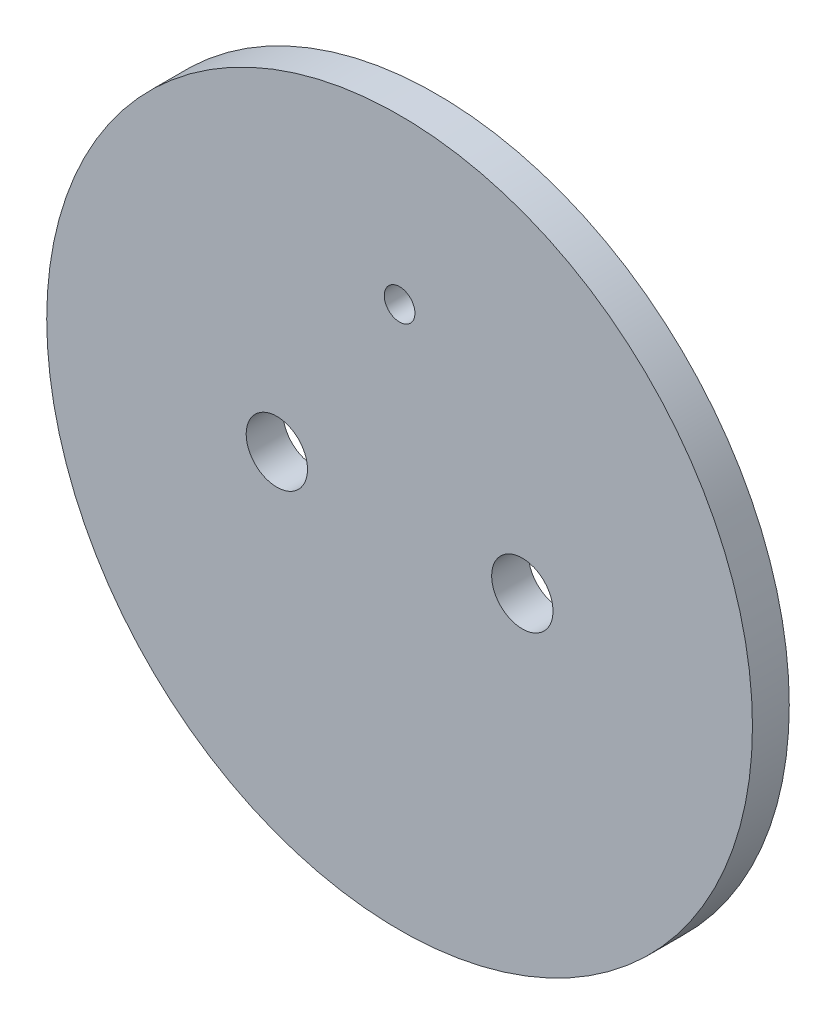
ISO-10303-21;
HEADER;
FILE_DESCRIPTION(('STEP AP214'),'2;1');
FILE_NAME('part.step','',(''),(''),'','','');
FILE_SCHEMA(('AUTOMOTIVE_DESIGN { 1 0 10303 214 1 1 1 1 }'));
ENDSEC;
DATA;
#1=APPLICATION_CONTEXT('core data for automotive mechanical design processes');
#2=APPLICATION_PROTOCOL_DEFINITION('international standard','automotive_design',2000,#1);
#3=PRODUCT_CONTEXT('',#1,'mechanical');
#4=PRODUCT('Part','Part','',(#3));
#5=PRODUCT_RELATED_PRODUCT_CATEGORY('part','',(#4));
#6=PRODUCT_DEFINITION_FORMATION('','',#4);
#7=PRODUCT_DEFINITION_CONTEXT('part definition',#1,'design');
#8=PRODUCT_DEFINITION('design','',#6,#7);
#9=PRODUCT_DEFINITION_SHAPE('','',#8);
#10=(LENGTH_UNIT() NAMED_UNIT(*) SI_UNIT(.MILLI.,.METRE.));
#11=(NAMED_UNIT(*) PLANE_ANGLE_UNIT() SI_UNIT($,.RADIAN.));
#12=(NAMED_UNIT(*) SI_UNIT($,.STERADIAN.) SOLID_ANGLE_UNIT());
#13=UNCERTAINTY_MEASURE_WITH_UNIT(LENGTH_MEASURE(1.E-05),#10,'distance_accuracy_value','');
#14=(GEOMETRIC_REPRESENTATION_CONTEXT(3) GLOBAL_UNCERTAINTY_ASSIGNED_CONTEXT((#13)) GLOBAL_UNIT_ASSIGNED_CONTEXT((#10,
#11,#12)) REPRESENTATION_CONTEXT('',''));
#15=CARTESIAN_POINT('',(0.,0.,0.));
#16=DIRECTION('',(0.,0.,1.));
#17=DIRECTION('',(1.,0.,0.));
#18=AXIS2_PLACEMENT_3D('',#15,#16,#17);
#19=CARTESIAN_POINT('',(0.,0.,3.81));
#20=DIRECTION('',(0.,0.,1.));
#21=DIRECTION('',(1.,0.,0.));
#22=AXIS2_PLACEMENT_3D('',#19,#20,#21);
#23=PLANE('',#22);
#24=CARTESIAN_POINT('',(12.7,0.,3.81));
#25=DIRECTION('',(0.,0.,1.));
#26=DIRECTION('',(1.,0.,0.));
#27=AXIS2_PLACEMENT_3D('',#24,#25,#26);
#28=CIRCLE('',#27,3.175);
#29=CARTESIAN_POINT('',(9.525,0.,3.81));
#30=VERTEX_POINT('',#29);
#31=EDGE_CURVE('E49',#30,#30,#28,.T.);
#32=ORIENTED_EDGE('',*,*,#31,.F.);
#33=EDGE_LOOP('',(#32));
#34=FACE_BOUND('',#33,.T.);
#35=CARTESIAN_POINT('',(0.,0.,3.81));
#36=DIRECTION('',(0.,0.,1.));
#37=DIRECTION('',(1.,0.,0.));
#38=AXIS2_PLACEMENT_3D('',#35,#36,#37);
#39=CIRCLE('',#38,36.5125);
#40=CARTESIAN_POINT('',(-36.5125,0.,3.81));
#41=VERTEX_POINT('',#40);
#42=EDGE_CURVE('E10',#41,#41,#39,.T.);
#43=ORIENTED_EDGE('',*,*,#42,.T.);
#44=EDGE_LOOP('',(#43));
#45=FACE_BOUND('',#44,.T.);
#46=CARTESIAN_POINT('',(0.,19.558,3.81));
#47=DIRECTION('',(0.,0.,1.));
#48=DIRECTION('',(1.,0.,0.));
#49=AXIS2_PLACEMENT_3D('',#46,#47,#48);
#50=CIRCLE('',#49,1.5875);
#51=CARTESIAN_POINT('',(-1.5875,19.558,3.81));
#52=VERTEX_POINT('',#51);
#53=EDGE_CURVE('E40',#52,#52,#50,.T.);
#54=ORIENTED_EDGE('',*,*,#53,.F.);
#55=EDGE_LOOP('',(#54));
#56=FACE_BOUND('',#55,.T.);
#57=CARTESIAN_POINT('',(-12.7,0.,3.81));
#58=DIRECTION('',(0.,0.,1.));
#59=DIRECTION('',(1.,0.,0.));
#60=AXIS2_PLACEMENT_3D('',#57,#58,#59);
#61=CIRCLE('',#60,3.175);
#62=CARTESIAN_POINT('',(-15.875,0.,3.81));
#63=VERTEX_POINT('',#62);
#64=EDGE_CURVE('E55',#63,#63,#61,.T.);
#65=ORIENTED_EDGE('',*,*,#64,.F.);
#66=EDGE_LOOP('',(#65));
#67=FACE_BOUND('',#66,.T.);
#68=ADVANCED_FACE('F29',(#34,#45,#56,#67),#23,.T.);
#69=CARTESIAN_POINT('',(0.,0.,0.));
#70=DIRECTION('',(0.,0.,1.));
#71=DIRECTION('',(1.,0.,0.));
#72=AXIS2_PLACEMENT_3D('',#69,#70,#71);
#73=PLANE('',#72);
#74=CARTESIAN_POINT('',(12.7,0.,0.));
#75=DIRECTION('',(0.,0.,1.));
#76=DIRECTION('',(1.,0.,0.));
#77=AXIS2_PLACEMENT_3D('',#74,#75,#76);
#78=CIRCLE('',#77,3.175);
#79=CARTESIAN_POINT('',(9.525,0.,0.));
#80=VERTEX_POINT('',#79);
#81=EDGE_CURVE('E52',#80,#80,#78,.T.);
#82=ORIENTED_EDGE('',*,*,#81,.T.);
#83=EDGE_LOOP('',(#82));
#84=FACE_BOUND('',#83,.T.);
#85=CARTESIAN_POINT('',(0.,0.,0.));
#86=DIRECTION('',(0.,0.,1.));
#87=DIRECTION('',(1.,0.,0.));
#88=AXIS2_PLACEMENT_3D('',#85,#86,#87);
#89=CIRCLE('',#88,36.5125);
#90=CARTESIAN_POINT('',(-36.5125,0.,0.));
#91=VERTEX_POINT('',#90);
#92=EDGE_CURVE('E36',#91,#91,#89,.T.);
#93=ORIENTED_EDGE('',*,*,#92,.F.);
#94=EDGE_LOOP('',(#93));
#95=FACE_BOUND('',#94,.T.);
#96=CARTESIAN_POINT('',(0.,19.558,0.));
#97=DIRECTION('',(0.,0.,1.));
#98=DIRECTION('',(1.,0.,0.));
#99=AXIS2_PLACEMENT_3D('',#96,#97,#98);
#100=CIRCLE('',#99,1.5875);
#101=CARTESIAN_POINT('',(-1.5875,19.558,0.));
#102=VERTEX_POINT('',#101);
#103=EDGE_CURVE('E44',#102,#102,#100,.T.);
#104=ORIENTED_EDGE('',*,*,#103,.T.);
#105=EDGE_LOOP('',(#104));
#106=FACE_BOUND('',#105,.T.);
#107=CARTESIAN_POINT('',(-12.7,0.,0.));
#108=DIRECTION('',(0.,0.,1.));
#109=DIRECTION('',(1.,0.,0.));
#110=AXIS2_PLACEMENT_3D('',#107,#108,#109);
#111=CIRCLE('',#110,3.175);
#112=CARTESIAN_POINT('',(-15.875,0.,0.));
#113=VERTEX_POINT('',#112);
#114=EDGE_CURVE('E58',#113,#113,#111,.T.);
#115=ORIENTED_EDGE('',*,*,#114,.T.);
#116=EDGE_LOOP('',(#115));
#117=FACE_BOUND('',#116,.T.);
#118=ADVANCED_FACE('F62',(#84,#95,#106,#117),#73,.F.);
#119=CARTESIAN_POINT('',(0.,0.,3.81));
#120=DIRECTION('',(0.,0.,-1.));
#121=DIRECTION('',(-1.,0.,0.));
#122=AXIS2_PLACEMENT_3D('',#119,#120,#121);
#123=CYLINDRICAL_SURFACE('',#122,36.5125);
#124=CARTESIAN_POINT('',(-36.5125,0.,3.81));
#125=CARTESIAN_POINT('',(-36.5125,0.,3.7703125));
#126=CARTESIAN_POINT('',(-36.5125,0.,3.730625));
#127=CARTESIAN_POINT('',(-36.5125,0.,3.65125));
#128=CARTESIAN_POINT('',(-36.5125,0.,3.6115625));
#129=CARTESIAN_POINT('',(-36.5125,0.,3.5321875));
#130=CARTESIAN_POINT('',(-36.5125,0.,3.4925));
#131=CARTESIAN_POINT('',(-36.5125,0.,3.413125));
#132=CARTESIAN_POINT('',(-36.5125,0.,3.3734375));
#133=CARTESIAN_POINT('',(-36.5125,0.,3.2940625));
#134=CARTESIAN_POINT('',(-36.5125,0.,3.254375));
#135=CARTESIAN_POINT('',(-36.5125,0.,3.175));
#136=CARTESIAN_POINT('',(-36.5125,0.,3.1353125));
#137=CARTESIAN_POINT('',(-36.5125,0.,3.0559375));
#138=CARTESIAN_POINT('',(-36.5125,0.,3.01625));
#139=CARTESIAN_POINT('',(-36.5125,0.,2.936875));
#140=CARTESIAN_POINT('',(-36.5125,0.,2.8971875));
#141=CARTESIAN_POINT('',(-36.5125,0.,2.8178125));
#142=CARTESIAN_POINT('',(-36.5125,0.,2.778125));
#143=CARTESIAN_POINT('',(-36.5125,0.,2.69875));
#144=CARTESIAN_POINT('',(-36.5125,0.,2.6590625));
#145=CARTESIAN_POINT('',(-36.5125,0.,2.5796875));
#146=CARTESIAN_POINT('',(-36.5125,0.,2.54));
#147=CARTESIAN_POINT('',(-36.5125,0.,2.460625));
#148=CARTESIAN_POINT('',(-36.5125,0.,2.4209375));
#149=CARTESIAN_POINT('',(-36.5125,0.,2.3415625));
#150=CARTESIAN_POINT('',(-36.5125,0.,2.301875));
#151=CARTESIAN_POINT('',(-36.5125,0.,2.2225));
#152=CARTESIAN_POINT('',(-36.5125,0.,2.1828125));
#153=CARTESIAN_POINT('',(-36.5125,0.,2.1034375));
#154=CARTESIAN_POINT('',(-36.5125,0.,2.06375));
#155=CARTESIAN_POINT('',(-36.5125,0.,1.984375));
#156=CARTESIAN_POINT('',(-36.5125,0.,1.9446875));
#157=CARTESIAN_POINT('',(-36.5125,0.,1.8653125));
#158=CARTESIAN_POINT('',(-36.5125,0.,1.825625));
#159=CARTESIAN_POINT('',(-36.5125,0.,1.74625));
#160=CARTESIAN_POINT('',(-36.5125,0.,1.7065625));
#161=CARTESIAN_POINT('',(-36.5125,0.,1.6271875));
#162=CARTESIAN_POINT('',(-36.5125,0.,1.5875));
#163=CARTESIAN_POINT('',(-36.5125,0.,1.508125));
#164=CARTESIAN_POINT('',(-36.5125,0.,1.4684375));
#165=CARTESIAN_POINT('',(-36.5125,0.,1.3890625));
#166=CARTESIAN_POINT('',(-36.5125,0.,1.349375));
#167=CARTESIAN_POINT('',(-36.5125,0.,1.27));
#168=CARTESIAN_POINT('',(-36.5125,0.,1.2303125));
#169=CARTESIAN_POINT('',(-36.5125,0.,1.1509375));
#170=CARTESIAN_POINT('',(-36.5125,0.,1.11125));
#171=CARTESIAN_POINT('',(-36.5125,0.,1.031875));
#172=CARTESIAN_POINT('',(-36.5125,0.,0.9921875));
#173=CARTESIAN_POINT('',(-36.5125,0.,0.9128125));
#174=CARTESIAN_POINT('',(-36.5125,0.,0.873125));
#175=CARTESIAN_POINT('',(-36.5125,0.,0.79375));
#176=CARTESIAN_POINT('',(-36.5125,0.,0.7540625));
#177=CARTESIAN_POINT('',(-36.5125,0.,0.6746875));
#178=CARTESIAN_POINT('',(-36.5125,0.,0.635));
#179=CARTESIAN_POINT('',(-36.5125,0.,0.555625));
#180=CARTESIAN_POINT('',(-36.5125,0.,0.5159375));
#181=CARTESIAN_POINT('',(-36.5125,0.,0.4365625));
#182=CARTESIAN_POINT('',(-36.5125,0.,0.396875));
#183=CARTESIAN_POINT('',(-36.5125,0.,0.3175));
#184=CARTESIAN_POINT('',(-36.5125,0.,0.2778125));
#185=CARTESIAN_POINT('',(-36.5125,0.,0.1984375));
#186=CARTESIAN_POINT('',(-36.5125,0.,0.15875));
#187=CARTESIAN_POINT('',(-36.5125,0.,0.0793749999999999));
#188=CARTESIAN_POINT('',(-36.5125,0.,0.0396874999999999));
#189=CARTESIAN_POINT('',(-36.5125,0.,0.));
#190=B_SPLINE_CURVE_WITH_KNOTS('',3,(#124,#125,#126,#127,#128,#129,#130,#131,#132,#133,#134,
#135,#136,#137,#138,#139,#140,#141,#142,#143,#144,#145,#146,#147,#148,#149,#150,#151,#152,#153,
#154,#155,#156,#157,#158,#159,#160,#161,#162,#163,#164,#165,#166,#167,#168,#169,#170,#171,#172,
#173,#174,#175,#176,#177,#178,#179,#180,#181,#182,#183,#184,#185,#186,#187,#188,#189),
.UNSPECIFIED.,.F.,.F.,(4,2,2,2,2,2,2,2,2,2,2,2,2,2,2,2,2,2,2,2,2,2,2,2,2,2,2,2,2,2,2,2,4),(0.,
0.1190625,0.238125,0.3571875,0.47625,0.5953125,0.714375,0.8334375,0.9525,1.0715625,1.190625,
1.3096875,1.42875,1.5478125,1.666875,1.7859375,1.905,2.0240625,2.143125,2.2621875,2.38125,
2.5003125,2.619375,2.7384375,2.8575,2.9765625,3.095625,3.2146875,3.33375,3.4528125,3.571875,
3.6909375,3.81),.UNSPECIFIED.);
#191=EDGE_CURVE('BSEAM31',#41,#91,#190,.T.);
#192=ORIENTED_EDGE('',*,*,#42,.F.);
#193=ORIENTED_EDGE('',*,*,#92,.T.);
#194=ORIENTED_EDGE('',*,*,#191,.T.);
#195=ORIENTED_EDGE('',*,*,#191,.F.);
#196=EDGE_LOOP('',(#192,#194,#193,#195));
#197=FACE_BOUND('',#196,.T.);
#198=ADVANCED_FACE('F31',(#197),#123,.T.);
#199=CARTESIAN_POINT('',(0.,19.558,3.81));
#200=DIRECTION('',(0.,0.,-1.));
#201=DIRECTION('',(-1.,0.,0.));
#202=AXIS2_PLACEMENT_3D('',#199,#200,#201);
#203=CYLINDRICAL_SURFACE('',#202,1.5875);
#204=CARTESIAN_POINT('',(-1.5875,19.558,3.81));
#205=CARTESIAN_POINT('',(-1.5875,19.558,3.7703125));
#206=CARTESIAN_POINT('',(-1.5875,19.558,3.730625));
#207=CARTESIAN_POINT('',(-1.5875,19.558,3.65125));
#208=CARTESIAN_POINT('',(-1.5875,19.558,3.6115625));
#209=CARTESIAN_POINT('',(-1.5875,19.558,3.5321875));
#210=CARTESIAN_POINT('',(-1.5875,19.558,3.4925));
#211=CARTESIAN_POINT('',(-1.5875,19.558,3.413125));
#212=CARTESIAN_POINT('',(-1.5875,19.558,3.3734375));
#213=CARTESIAN_POINT('',(-1.5875,19.558,3.2940625));
#214=CARTESIAN_POINT('',(-1.5875,19.558,3.254375));
#215=CARTESIAN_POINT('',(-1.5875,19.558,3.175));
#216=CARTESIAN_POINT('',(-1.5875,19.558,3.1353125));
#217=CARTESIAN_POINT('',(-1.5875,19.558,3.0559375));
#218=CARTESIAN_POINT('',(-1.5875,19.558,3.01625));
#219=CARTESIAN_POINT('',(-1.5875,19.558,2.936875));
#220=CARTESIAN_POINT('',(-1.5875,19.558,2.8971875));
#221=CARTESIAN_POINT('',(-1.5875,19.558,2.8178125));
#222=CARTESIAN_POINT('',(-1.5875,19.558,2.778125));
#223=CARTESIAN_POINT('',(-1.5875,19.558,2.69875));
#224=CARTESIAN_POINT('',(-1.5875,19.558,2.6590625));
#225=CARTESIAN_POINT('',(-1.5875,19.558,2.5796875));
#226=CARTESIAN_POINT('',(-1.5875,19.558,2.54));
#227=CARTESIAN_POINT('',(-1.5875,19.558,2.460625));
#228=CARTESIAN_POINT('',(-1.5875,19.558,2.4209375));
#229=CARTESIAN_POINT('',(-1.5875,19.558,2.3415625));
#230=CARTESIAN_POINT('',(-1.5875,19.558,2.301875));
#231=CARTESIAN_POINT('',(-1.5875,19.558,2.2225));
#232=CARTESIAN_POINT('',(-1.5875,19.558,2.1828125));
#233=CARTESIAN_POINT('',(-1.5875,19.558,2.1034375));
#234=CARTESIAN_POINT('',(-1.5875,19.558,2.06375));
#235=CARTESIAN_POINT('',(-1.5875,19.558,1.984375));
#236=CARTESIAN_POINT('',(-1.5875,19.558,1.9446875));
#237=CARTESIAN_POINT('',(-1.5875,19.558,1.8653125));
#238=CARTESIAN_POINT('',(-1.5875,19.558,1.825625));
#239=CARTESIAN_POINT('',(-1.5875,19.558,1.74625));
#240=CARTESIAN_POINT('',(-1.5875,19.558,1.7065625));
#241=CARTESIAN_POINT('',(-1.5875,19.558,1.6271875));
#242=CARTESIAN_POINT('',(-1.5875,19.558,1.5875));
#243=CARTESIAN_POINT('',(-1.5875,19.558,1.508125));
#244=CARTESIAN_POINT('',(-1.5875,19.558,1.4684375));
#245=CARTESIAN_POINT('',(-1.5875,19.558,1.3890625));
#246=CARTESIAN_POINT('',(-1.5875,19.558,1.349375));
#247=CARTESIAN_POINT('',(-1.5875,19.558,1.27));
#248=CARTESIAN_POINT('',(-1.5875,19.558,1.2303125));
#249=CARTESIAN_POINT('',(-1.5875,19.558,1.1509375));
#250=CARTESIAN_POINT('',(-1.5875,19.558,1.11125));
#251=CARTESIAN_POINT('',(-1.5875,19.558,1.031875));
#252=CARTESIAN_POINT('',(-1.5875,19.558,0.9921875));
#253=CARTESIAN_POINT('',(-1.5875,19.558,0.9128125));
#254=CARTESIAN_POINT('',(-1.5875,19.558,0.873125));
#255=CARTESIAN_POINT('',(-1.5875,19.558,0.79375));
#256=CARTESIAN_POINT('',(-1.5875,19.558,0.7540625));
#257=CARTESIAN_POINT('',(-1.5875,19.558,0.6746875));
#258=CARTESIAN_POINT('',(-1.5875,19.558,0.635));
#259=CARTESIAN_POINT('',(-1.5875,19.558,0.555625));
#260=CARTESIAN_POINT('',(-1.5875,19.558,0.5159375));
#261=CARTESIAN_POINT('',(-1.5875,19.558,0.4365625));
#262=CARTESIAN_POINT('',(-1.5875,19.558,0.396875));
#263=CARTESIAN_POINT('',(-1.5875,19.558,0.3175));
#264=CARTESIAN_POINT('',(-1.5875,19.558,0.2778125));
#265=CARTESIAN_POINT('',(-1.5875,19.558,0.1984375));
#266=CARTESIAN_POINT('',(-1.5875,19.558,0.15875));
#267=CARTESIAN_POINT('',(-1.5875,19.558,0.0793749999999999));
#268=CARTESIAN_POINT('',(-1.5875,19.558,0.0396874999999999));
#269=CARTESIAN_POINT('',(-1.5875,19.558,0.));
#270=B_SPLINE_CURVE_WITH_KNOTS('',3,(#204,#205,#206,#207,#208,#209,#210,#211,#212,#213,#214,
#215,#216,#217,#218,#219,#220,#221,#222,#223,#224,#225,#226,#227,#228,#229,#230,#231,#232,#233,
#234,#235,#236,#237,#238,#239,#240,#241,#242,#243,#244,#245,#246,#247,#248,#249,#250,#251,#252,
#253,#254,#255,#256,#257,#258,#259,#260,#261,#262,#263,#264,#265,#266,#267,#268,#269),
.UNSPECIFIED.,.F.,.F.,(4,2,2,2,2,2,2,2,2,2,2,2,2,2,2,2,2,2,2,2,2,2,2,2,2,2,2,2,2,2,2,2,4),(0.,
0.1190625,0.238125,0.3571875,0.47625,0.5953125,0.714375,0.8334375,0.9525,1.0715625,1.190625,
1.3096875,1.42875,1.5478125,1.666875,1.7859375,1.905,2.0240625,2.143125,2.2621875,2.38125,
2.5003125,2.619375,2.7384375,2.8575,2.9765625,3.095625,3.2146875,3.33375,3.4528125,3.571875,
3.6909375,3.81),.UNSPECIFIED.);
#271=EDGE_CURVE('BSEAM72',#52,#102,#270,.T.);
#272=ORIENTED_EDGE('',*,*,#53,.T.);
#273=ORIENTED_EDGE('',*,*,#103,.F.);
#274=ORIENTED_EDGE('',*,*,#271,.T.);
#275=ORIENTED_EDGE('',*,*,#271,.F.);
#276=EDGE_LOOP('',(#272,#274,#273,#275));
#277=FACE_BOUND('',#276,.T.);
#278=ADVANCED_FACE('F72',(#277),#203,.F.);
#279=CARTESIAN_POINT('',(12.7,0.,3.81));
#280=DIRECTION('',(0.,0.,-1.));
#281=DIRECTION('',(-1.,0.,0.));
#282=AXIS2_PLACEMENT_3D('',#279,#280,#281);
#283=CYLINDRICAL_SURFACE('',#282,3.175);
#284=CARTESIAN_POINT('',(9.525,0.,3.81));
#285=CARTESIAN_POINT('',(9.525,0.,3.7703125));
#286=CARTESIAN_POINT('',(9.525,0.,3.730625));
#287=CARTESIAN_POINT('',(9.525,0.,3.65125));
#288=CARTESIAN_POINT('',(9.525,0.,3.6115625));
#289=CARTESIAN_POINT('',(9.525,0.,3.5321875));
#290=CARTESIAN_POINT('',(9.525,0.,3.4925));
#291=CARTESIAN_POINT('',(9.525,0.,3.413125));
#292=CARTESIAN_POINT('',(9.525,0.,3.3734375));
#293=CARTESIAN_POINT('',(9.525,0.,3.2940625));
#294=CARTESIAN_POINT('',(9.525,0.,3.254375));
#295=CARTESIAN_POINT('',(9.525,0.,3.175));
#296=CARTESIAN_POINT('',(9.525,0.,3.1353125));
#297=CARTESIAN_POINT('',(9.525,0.,3.0559375));
#298=CARTESIAN_POINT('',(9.525,0.,3.01625));
#299=CARTESIAN_POINT('',(9.525,0.,2.936875));
#300=CARTESIAN_POINT('',(9.525,0.,2.8971875));
#301=CARTESIAN_POINT('',(9.525,0.,2.8178125));
#302=CARTESIAN_POINT('',(9.525,0.,2.778125));
#303=CARTESIAN_POINT('',(9.525,0.,2.69875));
#304=CARTESIAN_POINT('',(9.525,0.,2.6590625));
#305=CARTESIAN_POINT('',(9.525,0.,2.5796875));
#306=CARTESIAN_POINT('',(9.525,0.,2.54));
#307=CARTESIAN_POINT('',(9.525,0.,2.460625));
#308=CARTESIAN_POINT('',(9.525,0.,2.4209375));
#309=CARTESIAN_POINT('',(9.525,0.,2.3415625));
#310=CARTESIAN_POINT('',(9.525,0.,2.301875));
#311=CARTESIAN_POINT('',(9.525,0.,2.2225));
#312=CARTESIAN_POINT('',(9.525,0.,2.1828125));
#313=CARTESIAN_POINT('',(9.525,0.,2.1034375));
#314=CARTESIAN_POINT('',(9.525,0.,2.06375));
#315=CARTESIAN_POINT('',(9.525,0.,1.984375));
#316=CARTESIAN_POINT('',(9.525,0.,1.9446875));
#317=CARTESIAN_POINT('',(9.525,0.,1.8653125));
#318=CARTESIAN_POINT('',(9.525,0.,1.825625));
#319=CARTESIAN_POINT('',(9.525,0.,1.74625));
#320=CARTESIAN_POINT('',(9.525,0.,1.7065625));
#321=CARTESIAN_POINT('',(9.525,0.,1.6271875));
#322=CARTESIAN_POINT('',(9.525,0.,1.5875));
#323=CARTESIAN_POINT('',(9.525,0.,1.508125));
#324=CARTESIAN_POINT('',(9.525,0.,1.4684375));
#325=CARTESIAN_POINT('',(9.525,0.,1.3890625));
#326=CARTESIAN_POINT('',(9.525,0.,1.349375));
#327=CARTESIAN_POINT('',(9.525,0.,1.27));
#328=CARTESIAN_POINT('',(9.525,0.,1.2303125));
#329=CARTESIAN_POINT('',(9.525,0.,1.1509375));
#330=CARTESIAN_POINT('',(9.525,0.,1.11125));
#331=CARTESIAN_POINT('',(9.525,0.,1.031875));
#332=CARTESIAN_POINT('',(9.525,0.,0.9921875));
#333=CARTESIAN_POINT('',(9.525,0.,0.9128125));
#334=CARTESIAN_POINT('',(9.525,0.,0.873125));
#335=CARTESIAN_POINT('',(9.525,0.,0.79375));
#336=CARTESIAN_POINT('',(9.525,0.,0.7540625));
#337=CARTESIAN_POINT('',(9.525,0.,0.6746875));
#338=CARTESIAN_POINT('',(9.525,0.,0.635));
#339=CARTESIAN_POINT('',(9.525,0.,0.555625));
#340=CARTESIAN_POINT('',(9.525,0.,0.5159375));
#341=CARTESIAN_POINT('',(9.525,0.,0.4365625));
#342=CARTESIAN_POINT('',(9.525,0.,0.396875));
#343=CARTESIAN_POINT('',(9.525,0.,0.3175));
#344=CARTESIAN_POINT('',(9.525,0.,0.2778125));
#345=CARTESIAN_POINT('',(9.525,0.,0.1984375));
#346=CARTESIAN_POINT('',(9.525,0.,0.15875));
#347=CARTESIAN_POINT('',(9.525,0.,0.0793749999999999));
#348=CARTESIAN_POINT('',(9.525,0.,0.0396874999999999));
#349=CARTESIAN_POINT('',(9.525,0.,0.));
#350=B_SPLINE_CURVE_WITH_KNOTS('',3,(#284,#285,#286,#287,#288,#289,#290,#291,#292,#293,#294,
#295,#296,#297,#298,#299,#300,#301,#302,#303,#304,#305,#306,#307,#308,#309,#310,#311,#312,#313,
#314,#315,#316,#317,#318,#319,#320,#321,#322,#323,#324,#325,#326,#327,#328,#329,#330,#331,#332,
#333,#334,#335,#336,#337,#338,#339,#340,#341,#342,#343,#344,#345,#346,#347,#348,#349),
.UNSPECIFIED.,.F.,.F.,(4,2,2,2,2,2,2,2,2,2,2,2,2,2,2,2,2,2,2,2,2,2,2,2,2,2,2,2,2,2,2,2,4),(0.,
0.1190625,0.238125,0.3571875,0.47625,0.595312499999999,0.714375,0.833437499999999,
0.952499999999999,1.0715625,1.190625,1.3096875,1.42875,1.5478125,1.666875,1.7859375,1.905,
2.0240625,2.143125,2.2621875,2.38125,2.5003125,2.619375,2.7384375,2.8575,2.9765625,3.095625,
3.2146875,3.33375,3.4528125,3.571875,3.6909375,3.81),.UNSPECIFIED.);
#351=EDGE_CURVE('BSEAM66',#30,#80,#350,.T.);
#352=ORIENTED_EDGE('',*,*,#31,.T.);
#353=ORIENTED_EDGE('',*,*,#81,.F.);
#354=ORIENTED_EDGE('',*,*,#351,.T.);
#355=ORIENTED_EDGE('',*,*,#351,.F.);
#356=EDGE_LOOP('',(#352,#354,#353,#355));
#357=FACE_BOUND('',#356,.T.);
#358=ADVANCED_FACE('F66',(#357),#283,.F.);
#359=CARTESIAN_POINT('',(-12.7,0.,3.81));
#360=DIRECTION('',(0.,0.,-1.));
#361=DIRECTION('',(-1.,0.,0.));
#362=AXIS2_PLACEMENT_3D('',#359,#360,#361);
#363=CYLINDRICAL_SURFACE('',#362,3.175);
#364=CARTESIAN_POINT('',(-15.875,0.,3.81));
#365=CARTESIAN_POINT('',(-15.875,0.,3.7703125));
#366=CARTESIAN_POINT('',(-15.875,0.,3.730625));
#367=CARTESIAN_POINT('',(-15.875,0.,3.65125));
#368=CARTESIAN_POINT('',(-15.875,0.,3.6115625));
#369=CARTESIAN_POINT('',(-15.875,0.,3.5321875));
#370=CARTESIAN_POINT('',(-15.875,0.,3.4925));
#371=CARTESIAN_POINT('',(-15.875,0.,3.413125));
#372=CARTESIAN_POINT('',(-15.875,0.,3.3734375));
#373=CARTESIAN_POINT('',(-15.875,0.,3.2940625));
#374=CARTESIAN_POINT('',(-15.875,0.,3.254375));
#375=CARTESIAN_POINT('',(-15.875,0.,3.175));
#376=CARTESIAN_POINT('',(-15.875,0.,3.1353125));
#377=CARTESIAN_POINT('',(-15.875,0.,3.0559375));
#378=CARTESIAN_POINT('',(-15.875,0.,3.01625));
#379=CARTESIAN_POINT('',(-15.875,0.,2.936875));
#380=CARTESIAN_POINT('',(-15.875,0.,2.8971875));
#381=CARTESIAN_POINT('',(-15.875,0.,2.8178125));
#382=CARTESIAN_POINT('',(-15.875,0.,2.778125));
#383=CARTESIAN_POINT('',(-15.875,0.,2.69875));
#384=CARTESIAN_POINT('',(-15.875,0.,2.6590625));
#385=CARTESIAN_POINT('',(-15.875,0.,2.5796875));
#386=CARTESIAN_POINT('',(-15.875,0.,2.54));
#387=CARTESIAN_POINT('',(-15.875,0.,2.460625));
#388=CARTESIAN_POINT('',(-15.875,0.,2.4209375));
#389=CARTESIAN_POINT('',(-15.875,0.,2.3415625));
#390=CARTESIAN_POINT('',(-15.875,0.,2.301875));
#391=CARTESIAN_POINT('',(-15.875,0.,2.2225));
#392=CARTESIAN_POINT('',(-15.875,0.,2.1828125));
#393=CARTESIAN_POINT('',(-15.875,0.,2.1034375));
#394=CARTESIAN_POINT('',(-15.875,0.,2.06375));
#395=CARTESIAN_POINT('',(-15.875,0.,1.984375));
#396=CARTESIAN_POINT('',(-15.875,0.,1.9446875));
#397=CARTESIAN_POINT('',(-15.875,0.,1.8653125));
#398=CARTESIAN_POINT('',(-15.875,0.,1.825625));
#399=CARTESIAN_POINT('',(-15.875,0.,1.74625));
#400=CARTESIAN_POINT('',(-15.875,0.,1.7065625));
#401=CARTESIAN_POINT('',(-15.875,0.,1.6271875));
#402=CARTESIAN_POINT('',(-15.875,0.,1.5875));
#403=CARTESIAN_POINT('',(-15.875,0.,1.508125));
#404=CARTESIAN_POINT('',(-15.875,0.,1.4684375));
#405=CARTESIAN_POINT('',(-15.875,0.,1.3890625));
#406=CARTESIAN_POINT('',(-15.875,0.,1.349375));
#407=CARTESIAN_POINT('',(-15.875,0.,1.27));
#408=CARTESIAN_POINT('',(-15.875,0.,1.2303125));
#409=CARTESIAN_POINT('',(-15.875,0.,1.1509375));
#410=CARTESIAN_POINT('',(-15.875,0.,1.11125));
#411=CARTESIAN_POINT('',(-15.875,0.,1.031875));
#412=CARTESIAN_POINT('',(-15.875,0.,0.9921875));
#413=CARTESIAN_POINT('',(-15.875,0.,0.9128125));
#414=CARTESIAN_POINT('',(-15.875,0.,0.873125));
#415=CARTESIAN_POINT('',(-15.875,0.,0.79375));
#416=CARTESIAN_POINT('',(-15.875,0.,0.7540625));
#417=CARTESIAN_POINT('',(-15.875,0.,0.6746875));
#418=CARTESIAN_POINT('',(-15.875,0.,0.635));
#419=CARTESIAN_POINT('',(-15.875,0.,0.555625));
#420=CARTESIAN_POINT('',(-15.875,0.,0.5159375));
#421=CARTESIAN_POINT('',(-15.875,0.,0.4365625));
#422=CARTESIAN_POINT('',(-15.875,0.,0.396875));
#423=CARTESIAN_POINT('',(-15.875,0.,0.3175));
#424=CARTESIAN_POINT('',(-15.875,0.,0.2778125));
#425=CARTESIAN_POINT('',(-15.875,0.,0.1984375));
#426=CARTESIAN_POINT('',(-15.875,0.,0.15875));
#427=CARTESIAN_POINT('',(-15.875,0.,0.0793749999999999));
#428=CARTESIAN_POINT('',(-15.875,0.,0.0396874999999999));
#429=CARTESIAN_POINT('',(-15.875,0.,0.));
#430=B_SPLINE_CURVE_WITH_KNOTS('',3,(#364,#365,#366,#367,#368,#369,#370,#371,#372,#373,#374,
#375,#376,#377,#378,#379,#380,#381,#382,#383,#384,#385,#386,#387,#388,#389,#390,#391,#392,#393,
#394,#395,#396,#397,#398,#399,#400,#401,#402,#403,#404,#405,#406,#407,#408,#409,#410,#411,#412,
#413,#414,#415,#416,#417,#418,#419,#420,#421,#422,#423,#424,#425,#426,#427,#428,#429),
.UNSPECIFIED.,.F.,.F.,(4,2,2,2,2,2,2,2,2,2,2,2,2,2,2,2,2,2,2,2,2,2,2,2,2,2,2,2,2,2,2,2,4),(0.,
0.1190625,0.238125,0.3571875,0.47625,0.595312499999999,0.714375,0.833437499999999,
0.952499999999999,1.0715625,1.190625,1.3096875,1.42875,1.5478125,1.666875,1.7859375,1.905,
2.0240625,2.143125,2.2621875,2.38125,2.5003125,2.619375,2.7384375,2.8575,2.9765625,3.095625,
3.2146875,3.33375,3.4528125,3.571875,3.6909375,3.81),.UNSPECIFIED.);
#431=EDGE_CURVE('BSEAM64',#63,#113,#430,.T.);
#432=ORIENTED_EDGE('',*,*,#64,.T.);
#433=ORIENTED_EDGE('',*,*,#114,.F.);
#434=ORIENTED_EDGE('',*,*,#431,.T.);
#435=ORIENTED_EDGE('',*,*,#431,.F.);
#436=EDGE_LOOP('',(#432,#434,#433,#435));
#437=FACE_BOUND('',#436,.T.);
#438=ADVANCED_FACE('F64',(#437),#363,.F.);
#439=CLOSED_SHELL('',(#68,#118,#198,#278,#358,#438));
#440=MANIFOLD_SOLID_BREP('B2',#439);
#441=ADVANCED_BREP_SHAPE_REPRESENTATION('',(#18,#440),#14);
#442=SHAPE_DEFINITION_REPRESENTATION(#9,#441);
ENDSEC;
END-ISO-10303-21;
